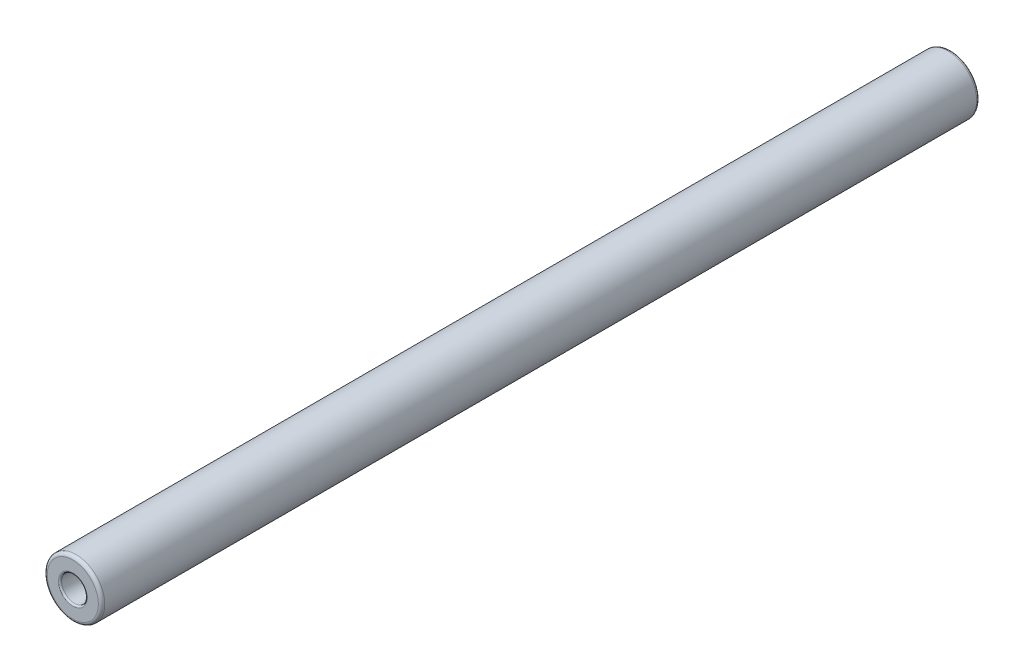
from build123d import *

# Parameters (mm, degrees)
SCHIZZO1_R               = 18
RACCORDO1_R              = 2
SCHIZZO7_R               = 8
TAGLIO_ESTRUSIONE3_DEPTH = 70
TAGLIO_ESTRUSIONE4_START = -70
SCHIZZO11_R              = 8
TAGLIO_ESTRUSIONE4_DEPTH = 70
RACCORDO2_R              = 1


with BuildPart() as part:
    # Sweep1: sweep along a path in Schizzo2
    with BuildLine(Plane(origin=(0, 0, 0), x_dir=(0, 0, -1), z_dir=(1, 0, 0))) as sweep1_path:
        Line((0, 0), (550, 0))
    # Schizzo1 → Sweep1 (sweep)
    with BuildSketch(Plane.XY):
        Circle(SCHIZZO1_R)
    sweep(path=sweep1_path.line)

    # Raccordo1
    raccordo1_edges = [part.edges().sort_by_distance(p)[0] for p in [
        (-18, 0, 0),
        (-18, 0, -550),
    ]]
    fillet(raccordo1_edges, radius=RACCORDO1_R)

    # Schizzo7 → Taglio-Estrusione3 (cut)
    with BuildSketch(Plane.XY):
        Circle(SCHIZZO7_R)
    extrude(amount=-TAGLIO_ESTRUSIONE3_DEPTH, mode=Mode.SUBTRACT)

    # Schizzo11 → Taglio-Estrusione4 (cut)
    with BuildSketch(Plane(origin=(0, 0, -550), x_dir=(-1, 0, 0), z_dir=(0, 0, -1)).offset(TAGLIO_ESTRUSIONE4_START)):
        with Locations(Location((0, 0, 0), (0, 0, 180))):
            Circle(SCHIZZO11_R)
    extrude(amount=TAGLIO_ESTRUSIONE4_DEPTH, mode=Mode.SUBTRACT)

    # Raccordo2
    raccordo2_edges = [part.edges().sort_by_distance(p)[0] for p in [
        (-8, 0, 0),
        (-8, 0, -550),
    ]]
    fillet(raccordo2_edges, radius=RACCORDO2_R)


solid = part.part
